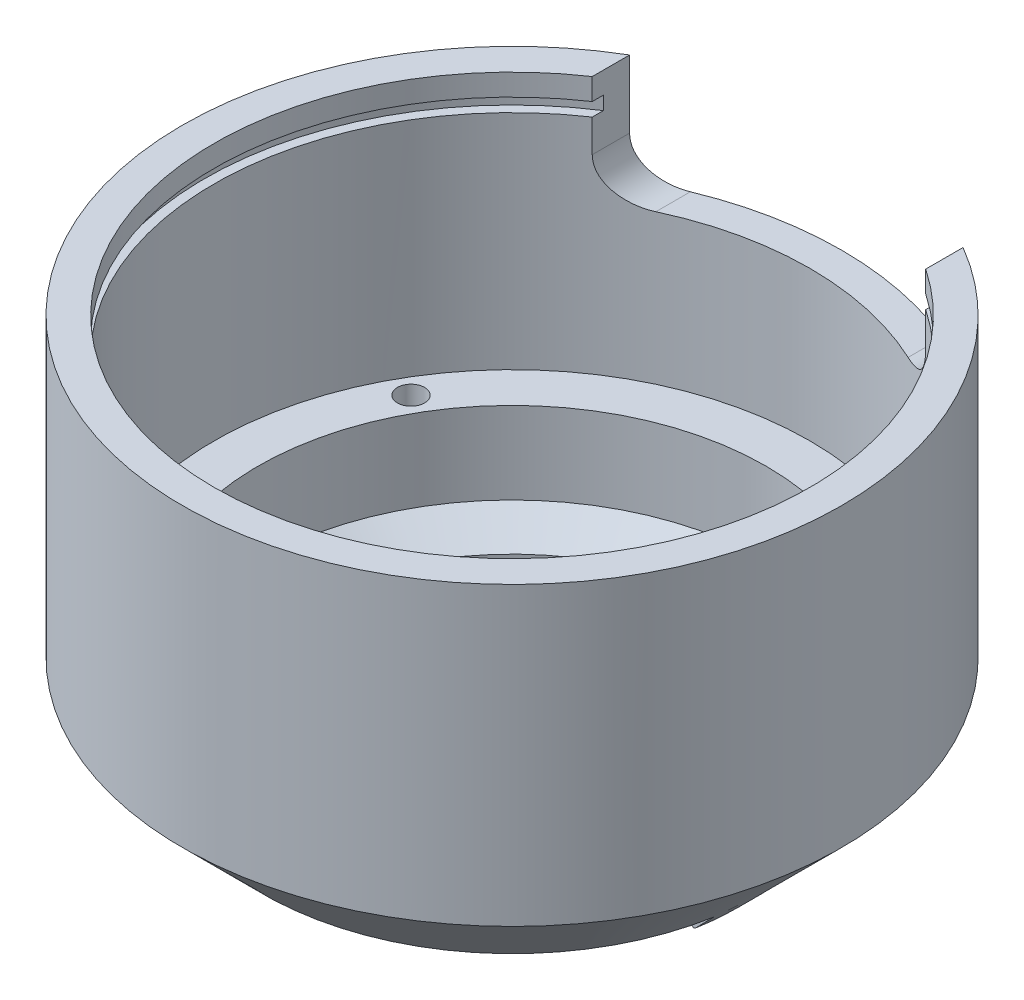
from build123d import *

# Parameters (mm, degrees)
CUT_EXTRUDE2_START                 = 1.397
CUT_EXTRUDE2_DEPTH                 = 1.397
CIRPATTERN1_COUNT                  = 3
F_1_16_0_0625_DIAMETER_HOLE1_D     = 1.5875
F_1_16_0_0625_DIAMETER_HOLE1_DEPTH = 3.81
CIRPATTERN2_COUNT                  = 3
SKETCH11_W                         = 19.558
SKETCH11_H                         = 6.35
CUT_EXTRUDE3_DEPTH                 = 37.045338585
FILLET1_R                          = 2.38125


with BuildPart() as part:
    # Sketch1 → Revolve1 (revolve)
    with BuildSketch(Plane.XY, mode=Mode.PRIVATE) as revolve1_sk:
        with BuildLine():
            Line((-14.90726, 8.382), (-14.90726, 3.577487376))
            Line((-14.90726, 3.577487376), (-12.954, 2.2098))
            Line((-12.954, 2.2098), (-12.954, 0.1778))
            ThreePointArc((-12.954, 0.1778), (-13.063758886, 0.013534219), (-13.257523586, 0.052076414))
            Line((-13.257523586, 0.052076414), (-19.3294, 6.123952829))
            Line((-19.3294, 6.123952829), (-19.3294, 23.495))
            Line((-19.3294, 23.495), (-17.4752, 23.495))
            Line((-17.4752, 23.495), (-17.4752, 22.225))
            Line((-17.4752, 22.225), (-18.0213, 22.225))
            Line((-18.0213, 22.225), (-18.0213, 21.4376))
            Line((-18.0213, 21.4376), (-17.4752, 21.4376))
            Line((-17.4752, 21.4376), (-17.4752, 8.382))
            Line((-17.4752, 8.382), (-14.90726, 8.382))
        make_face()
    revolve(revolve1_sk.sketch.rotate(Axis((0, 0, 0), (0, 1, 0)), 270), axis=Axis((0, 0, 0), (0, 1, 0)))

    # Sketch8 → Cut-Extrude2 (cut)
    with BuildSketch(Plane(origin=(0, 0, 0), x_dir=(1, 0, 0), z_dir=(0, 1, 0)).offset(CUT_EXTRUDE2_START)):
        with BuildLine():
            Line((0, 0), (19.3294, 0))
            ThreePointArc((19.3294, 0), (11.086888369, 15.833717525), (-6.611044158, 18.163694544))
            Line((-6.611044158, 18.163694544), (0, 0))
        make_face()
    cut_extrude2 = extrude(amount=-CUT_EXTRUDE2_DEPTH, mode=Mode.SUBTRACT)

    # CirPattern1: Cut-Extrude2 ×3 about axis
    cirpattern1_axis = Axis((0, 0, 0), (0, 1, 0))
    for i in range(1, CIRPATTERN1_COUNT):
        add(cut_extrude2.rotate(cirpattern1_axis, i * 360 / CIRPATTERN1_COUNT), mode=Mode.SUBTRACT)

    # 1_16 _0.0625_ Diameter Hole1
    with Locations(Plane(origin=(0, 8.382, 0), x_dir=(-1, 0, 0), z_dir=(0, 1, 0))):
        with Locations((0, 16.19123)):
            f_1_16_0_0625_diameter_hole1 = Hole(F_1_16_0_0625_DIAMETER_HOLE1_D / 2, depth=F_1_16_0_0625_DIAMETER_HOLE1_DEPTH)

    # CirPattern2: 1_16 _0.0625_ Diameter Hole1 ×3 about axis
    cirpattern2_axis = Axis((0, 0, 0), (0, 1, 0))
    for i in range(1, CIRPATTERN2_COUNT):
        add(f_1_16_0_0625_diameter_hole1.rotate(cirpattern2_axis, i * 360 / CIRPATTERN2_COUNT), mode=Mode.SUBTRACT)

    # Sketch11 → Cut-Extrude3 (cut, through all)
    with BuildSketch(Plane.XY):
        with Locations((0, 20.32)):
            Rectangle(SKETCH11_W, SKETCH11_H)
    extrude(amount=-CUT_EXTRUDE3_DEPTH, mode=Mode.SUBTRACT)

    # Fillet1
    fillet1_edges = [part.edges().sort_by_distance(p)[0] for p in [
        (-9.779, 17.145, -15.578058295),
        (9.779, 17.145, -15.578058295),
    ]]
    fillet(fillet1_edges, radius=FILLET1_R)


solid = part.part
